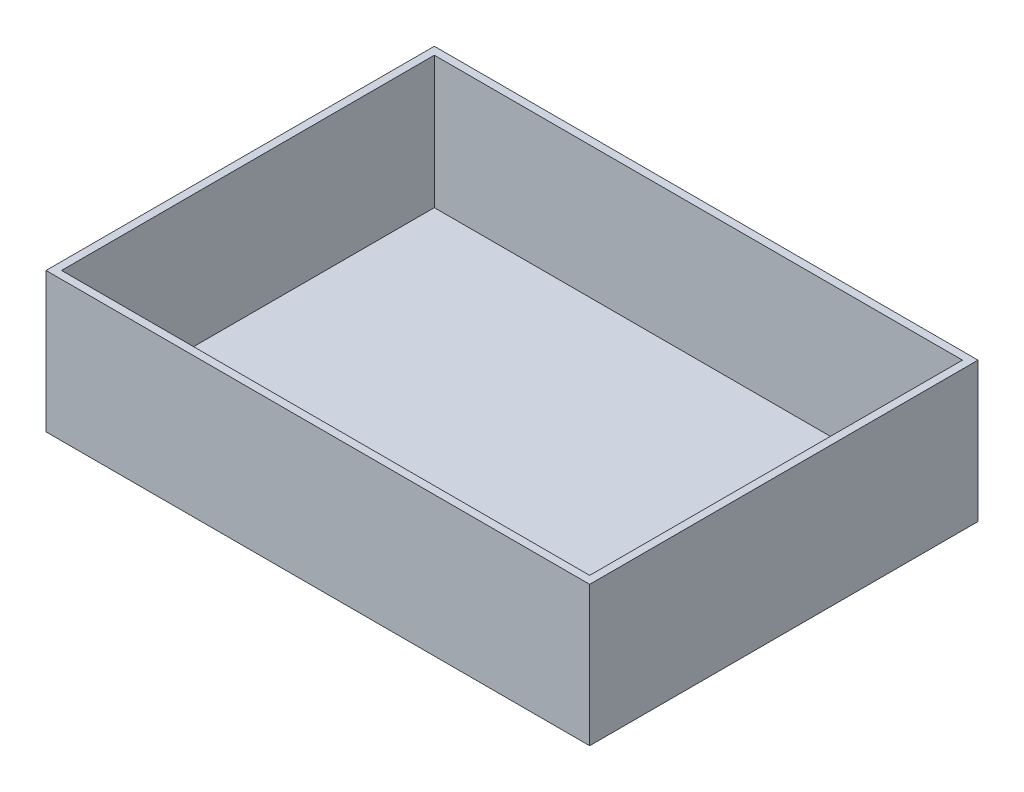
ISO-10303-21;
HEADER;
FILE_DESCRIPTION(('STEP AP214'),'2;1');
FILE_NAME('part.step','',(''),(''),'','','');
FILE_SCHEMA(('AUTOMOTIVE_DESIGN { 1 0 10303 214 1 1 1 1 }'));
ENDSEC;
DATA;
#1=APPLICATION_CONTEXT('core data for automotive mechanical design processes');
#2=APPLICATION_PROTOCOL_DEFINITION('international standard','automotive_design',2000,#1);
#3=PRODUCT_CONTEXT('',#1,'mechanical');
#4=PRODUCT('Part','Part','',(#3));
#5=PRODUCT_RELATED_PRODUCT_CATEGORY('part','',(#4));
#6=PRODUCT_DEFINITION_FORMATION('','',#4);
#7=PRODUCT_DEFINITION_CONTEXT('part definition',#1,'design');
#8=PRODUCT_DEFINITION('design','',#6,#7);
#9=PRODUCT_DEFINITION_SHAPE('','',#8);
#10=(LENGTH_UNIT() NAMED_UNIT(*) SI_UNIT(.MILLI.,.METRE.));
#11=(NAMED_UNIT(*) PLANE_ANGLE_UNIT() SI_UNIT($,.RADIAN.));
#12=(NAMED_UNIT(*) SI_UNIT($,.STERADIAN.) SOLID_ANGLE_UNIT());
#13=UNCERTAINTY_MEASURE_WITH_UNIT(LENGTH_MEASURE(1.E-05),#10,'distance_accuracy_value','');
#14=(GEOMETRIC_REPRESENTATION_CONTEXT(3) GLOBAL_UNCERTAINTY_ASSIGNED_CONTEXT((#13)) GLOBAL_UNIT_ASSIGNED_CONTEXT((#10,
#11,#12)) REPRESENTATION_CONTEXT('',''));
#15=CARTESIAN_POINT('',(0.,0.,0.));
#16=DIRECTION('',(0.,0.,1.));
#17=DIRECTION('',(1.,0.,0.));
#18=AXIS2_PLACEMENT_3D('',#15,#16,#17);
#19=CARTESIAN_POINT('',(-364.202898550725,234.347826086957,500.));
#20=DIRECTION('',(0.,-1.,0.));
#21=DIRECTION('',(0.,0.,-1.));
#22=AXIS2_PLACEMENT_3D('',#19,#20,#21);
#23=PLANE('',#22);
#24=DIRECTION('',(-1.,0.,0.));
#25=VECTOR('',#24,1.);
#26=CARTESIAN_POINT('',(-364.202898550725,234.347826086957,0.));
#27=LINE('',#26,#25);
#28=CARTESIAN_POINT('',(335.797101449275,234.347826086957,0.));
#29=VERTEX_POINT('',#28);
#30=CARTESIAN_POINT('',(-364.202898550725,234.347826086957,0.));
#31=VERTEX_POINT('',#30);
#32=EDGE_CURVE('E77',#29,#31,#27,.T.);
#33=ORIENTED_EDGE('',*,*,#32,.T.);
#34=DIRECTION('',(0.,0.,-1.));
#35=VECTOR('',#34,1.);
#36=CARTESIAN_POINT('',(-364.202898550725,234.347826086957,500.));
#37=LINE('',#36,#35);
#38=CARTESIAN_POINT('',(-364.202898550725,234.347826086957,500.));
#39=VERTEX_POINT('',#38);
#40=EDGE_CURVE('E149',#39,#31,#37,.T.);
#41=ORIENTED_EDGE('',*,*,#40,.F.);
#42=DIRECTION('',(-1.,0.,0.));
#43=VECTOR('',#42,1.);
#44=CARTESIAN_POINT('',(-364.202898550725,234.347826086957,500.));
#45=LINE('',#44,#43);
#46=CARTESIAN_POINT('',(335.797101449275,234.347826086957,500.));
#47=VERTEX_POINT('',#46);
#48=EDGE_CURVE('E56',#47,#39,#45,.T.);
#49=ORIENTED_EDGE('',*,*,#48,.F.);
#50=DIRECTION('',(0.,0.,-1.));
#51=VECTOR('',#50,1.);
#52=CARTESIAN_POINT('',(335.797101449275,234.347826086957,500.));
#53=LINE('',#52,#51);
#54=EDGE_CURVE('E159',#47,#29,#53,.T.);
#55=ORIENTED_EDGE('',*,*,#54,.T.);
#56=EDGE_LOOP('',(#33,#41,#49,#55));
#57=FACE_BOUND('',#56,.T.);
#58=DIRECTION('',(-1.,0.,0.));
#59=VECTOR('',#58,1.);
#60=CARTESIAN_POINT('',(-364.202898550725,234.347826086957,10.));
#61=LINE('',#60,#59);
#62=CARTESIAN_POINT('',(325.797101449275,234.347826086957,10.));
#63=VERTEX_POINT('',#62);
#64=CARTESIAN_POINT('',(-354.202898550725,234.347826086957,10.));
#65=VERTEX_POINT('',#64);
#66=EDGE_CURVE('E130',#63,#65,#61,.T.);
#67=ORIENTED_EDGE('',*,*,#66,.F.);
#68=DIRECTION('',(0.,0.,-1.));
#69=VECTOR('',#68,1.);
#70=CARTESIAN_POINT('',(325.797101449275,234.347826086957,500.));
#71=LINE('',#70,#69);
#72=CARTESIAN_POINT('',(325.797101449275,234.347826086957,490.));
#73=VERTEX_POINT('',#72);
#74=EDGE_CURVE('E125',#73,#63,#71,.T.);
#75=ORIENTED_EDGE('',*,*,#74,.F.);
#76=DIRECTION('',(-1.,0.,0.));
#77=VECTOR('',#76,1.);
#78=CARTESIAN_POINT('',(-364.202898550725,234.347826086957,490.));
#79=LINE('',#78,#77);
#80=CARTESIAN_POINT('',(-354.202898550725,234.347826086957,490.));
#81=VERTEX_POINT('',#80);
#82=EDGE_CURVE('E47',#73,#81,#79,.T.);
#83=ORIENTED_EDGE('',*,*,#82,.T.);
#84=DIRECTION('',(0.,0.,-1.));
#85=VECTOR('',#84,1.);
#86=CARTESIAN_POINT('',(-354.202898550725,234.347826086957,500.));
#87=LINE('',#86,#85);
#88=EDGE_CURVE('E138',#81,#65,#87,.T.);
#89=ORIENTED_EDGE('',*,*,#88,.T.);
#90=EDGE_LOOP('',(#67,#75,#83,#89));
#91=FACE_BOUND('',#90,.T.);
#92=ADVANCED_FACE('F32',(#57,#91),#23,.F.);
#93=CARTESIAN_POINT('',(-364.202898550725,234.347826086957,500.));
#94=DIRECTION('',(1.,0.,0.));
#95=DIRECTION('',(0.,0.,-1.));
#96=AXIS2_PLACEMENT_3D('',#93,#94,#95);
#97=PLANE('',#96);
#98=DIRECTION('',(0.,-1.,0.));
#99=VECTOR('',#98,1.);
#100=CARTESIAN_POINT('',(-364.202898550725,234.347826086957,0.));
#101=LINE('',#100,#99);
#102=CARTESIAN_POINT('',(-364.202898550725,54.3478260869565,0.));
#103=VERTEX_POINT('',#102);
#104=EDGE_CURVE('E150',#31,#103,#101,.T.);
#105=ORIENTED_EDGE('',*,*,#104,.T.);
#106=DIRECTION('',(0.,0.,-1.));
#107=VECTOR('',#106,1.);
#108=CARTESIAN_POINT('',(-364.202898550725,54.3478260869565,500.));
#109=LINE('',#108,#107);
#110=CARTESIAN_POINT('',(-364.202898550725,54.3478260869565,500.));
#111=VERTEX_POINT('',#110);
#112=EDGE_CURVE('E11',#111,#103,#109,.T.);
#113=ORIENTED_EDGE('',*,*,#112,.F.);
#114=DIRECTION('',(0.,-1.,0.));
#115=VECTOR('',#114,1.);
#116=CARTESIAN_POINT('',(-364.202898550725,234.347826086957,500.));
#117=LINE('',#116,#115);
#118=EDGE_CURVE('E143',#39,#111,#117,.T.);
#119=ORIENTED_EDGE('',*,*,#118,.F.);
#120=ORIENTED_EDGE('',*,*,#40,.T.);
#121=EDGE_LOOP('',(#105,#113,#119,#120));
#122=FACE_BOUND('',#121,.T.);
#123=ADVANCED_FACE('F34',(#122),#97,.F.);
#124=CARTESIAN_POINT('',(-364.202898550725,54.3478260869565,500.));
#125=DIRECTION('',(0.,1.,0.));
#126=DIRECTION('',(0.,0.,1.));
#127=AXIS2_PLACEMENT_3D('',#124,#125,#126);
#128=PLANE('',#127);
#129=DIRECTION('',(1.,0.,0.));
#130=VECTOR('',#129,1.);
#131=CARTESIAN_POINT('',(-364.202898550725,54.3478260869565,0.));
#132=LINE('',#131,#130);
#133=CARTESIAN_POINT('',(335.797101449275,54.3478260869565,0.));
#134=VERTEX_POINT('',#133);
#135=EDGE_CURVE('E153',#103,#134,#132,.T.);
#136=ORIENTED_EDGE('',*,*,#135,.T.);
#137=DIRECTION('',(0.,0.,-1.));
#138=VECTOR('',#137,1.);
#139=CARTESIAN_POINT('',(335.797101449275,54.3478260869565,500.));
#140=LINE('',#139,#138);
#141=CARTESIAN_POINT('',(335.797101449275,54.3478260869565,500.));
#142=VERTEX_POINT('',#141);
#143=EDGE_CURVE('E40',#142,#134,#140,.T.);
#144=ORIENTED_EDGE('',*,*,#143,.F.);
#145=DIRECTION('',(1.,0.,0.));
#146=VECTOR('',#145,1.);
#147=CARTESIAN_POINT('',(-364.202898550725,54.3478260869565,500.));
#148=LINE('',#147,#146);
#149=EDGE_CURVE('E84',#111,#142,#148,.T.);
#150=ORIENTED_EDGE('',*,*,#149,.F.);
#151=ORIENTED_EDGE('',*,*,#112,.T.);
#152=EDGE_LOOP('',(#136,#144,#150,#151));
#153=FACE_BOUND('',#152,.T.);
#154=ADVANCED_FACE('F198',(#153),#128,.F.);
#155=CARTESIAN_POINT('',(335.797101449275,234.347826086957,500.));
#156=DIRECTION('',(-1.,0.,0.));
#157=DIRECTION('',(0.,0.,1.));
#158=AXIS2_PLACEMENT_3D('',#155,#156,#157);
#159=PLANE('',#158);
#160=DIRECTION('',(0.,1.,0.));
#161=VECTOR('',#160,1.);
#162=CARTESIAN_POINT('',(335.797101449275,234.347826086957,0.));
#163=LINE('',#162,#161);
#164=EDGE_CURVE('E155',#134,#29,#163,.T.);
#165=ORIENTED_EDGE('',*,*,#164,.T.);
#166=ORIENTED_EDGE('',*,*,#54,.F.);
#167=DIRECTION('',(0.,1.,0.));
#168=VECTOR('',#167,1.);
#169=CARTESIAN_POINT('',(335.797101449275,234.347826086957,500.));
#170=LINE('',#169,#168);
#171=EDGE_CURVE('E146',#142,#47,#170,.T.);
#172=ORIENTED_EDGE('',*,*,#171,.F.);
#173=ORIENTED_EDGE('',*,*,#143,.T.);
#174=EDGE_LOOP('',(#165,#166,#172,#173));
#175=FACE_BOUND('',#174,.T.);
#176=ADVANCED_FACE('F164',(#175),#159,.F.);
#177=CARTESIAN_POINT('',(0.,0.,500.));
#178=DIRECTION('',(0.,0.,1.));
#179=DIRECTION('',(1.,0.,0.));
#180=AXIS2_PLACEMENT_3D('',#177,#178,#179);
#181=PLANE('',#180);
#182=ORIENTED_EDGE('',*,*,#118,.T.);
#183=ORIENTED_EDGE('',*,*,#149,.T.);
#184=ORIENTED_EDGE('',*,*,#171,.T.);
#185=ORIENTED_EDGE('',*,*,#48,.T.);
#186=EDGE_LOOP('',(#182,#183,#184,#185));
#187=FACE_BOUND('',#186,.T.);
#188=ADVANCED_FACE('F192',(#187),#181,.T.);
#189=CARTESIAN_POINT('',(0.,0.,0.));
#190=DIRECTION('',(0.,0.,1.));
#191=DIRECTION('',(1.,0.,0.));
#192=AXIS2_PLACEMENT_3D('',#189,#190,#191);
#193=PLANE('',#192);
#194=ORIENTED_EDGE('',*,*,#104,.F.);
#195=ORIENTED_EDGE('',*,*,#32,.F.);
#196=ORIENTED_EDGE('',*,*,#164,.F.);
#197=ORIENTED_EDGE('',*,*,#135,.F.);
#198=EDGE_LOOP('',(#194,#195,#196,#197));
#199=FACE_BOUND('',#198,.T.);
#200=ADVANCED_FACE('F168',(#199),#193,.F.);
#201=CARTESIAN_POINT('',(-354.202898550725,234.347826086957,500.));
#202=DIRECTION('',(1.,0.,0.));
#203=DIRECTION('',(0.,0.,-1.));
#204=AXIS2_PLACEMENT_3D('',#201,#202,#203);
#205=PLANE('',#204);
#206=DIRECTION('',(0.,-1.,0.));
#207=VECTOR('',#206,1.);
#208=CARTESIAN_POINT('',(-354.202898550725,234.347826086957,10.));
#209=LINE('',#208,#207);
#210=CARTESIAN_POINT('',(-354.202898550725,64.3478260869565,10.));
#211=VERTEX_POINT('',#210);
#212=EDGE_CURVE('E114',#65,#211,#209,.T.);
#213=ORIENTED_EDGE('',*,*,#212,.F.);
#214=ORIENTED_EDGE('',*,*,#88,.F.);
#215=DIRECTION('',(0.,-1.,0.));
#216=VECTOR('',#215,1.);
#217=CARTESIAN_POINT('',(-354.202898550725,234.347826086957,490.));
#218=LINE('',#217,#216);
#219=CARTESIAN_POINT('',(-354.202898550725,64.3478260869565,490.));
#220=VERTEX_POINT('',#219);
#221=EDGE_CURVE('E132',#81,#220,#218,.T.);
#222=ORIENTED_EDGE('',*,*,#221,.T.);
#223=DIRECTION('',(0.,0.,-1.));
#224=VECTOR('',#223,1.);
#225=CARTESIAN_POINT('',(-354.202898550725,64.3478260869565,500.));
#226=LINE('',#225,#224);
#227=EDGE_CURVE('E124',#220,#211,#226,.T.);
#228=ORIENTED_EDGE('',*,*,#227,.T.);
#229=EDGE_LOOP('',(#213,#214,#222,#228));
#230=FACE_BOUND('',#229,.T.);
#231=ADVANCED_FACE('F176',(#230),#205,.T.);
#232=CARTESIAN_POINT('',(-364.202898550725,64.3478260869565,500.));
#233=DIRECTION('',(0.,1.,0.));
#234=DIRECTION('',(0.,0.,1.));
#235=AXIS2_PLACEMENT_3D('',#232,#233,#234);
#236=PLANE('',#235);
#237=DIRECTION('',(1.,0.,0.));
#238=VECTOR('',#237,1.);
#239=CARTESIAN_POINT('',(-364.202898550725,64.3478260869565,10.));
#240=LINE('',#239,#238);
#241=CARTESIAN_POINT('',(325.797101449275,64.3478260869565,10.));
#242=VERTEX_POINT('',#241);
#243=EDGE_CURVE('E107',#211,#242,#240,.T.);
#244=ORIENTED_EDGE('',*,*,#243,.F.);
#245=ORIENTED_EDGE('',*,*,#227,.F.);
#246=DIRECTION('',(1.,0.,0.));
#247=VECTOR('',#246,1.);
#248=CARTESIAN_POINT('',(-364.202898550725,64.3478260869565,490.));
#249=LINE('',#248,#247);
#250=CARTESIAN_POINT('',(325.797101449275,64.3478260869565,490.));
#251=VERTEX_POINT('',#250);
#252=EDGE_CURVE('E122',#220,#251,#249,.T.);
#253=ORIENTED_EDGE('',*,*,#252,.T.);
#254=DIRECTION('',(0.,0.,-1.));
#255=VECTOR('',#254,1.);
#256=CARTESIAN_POINT('',(325.797101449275,64.3478260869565,500.));
#257=LINE('',#256,#255);
#258=EDGE_CURVE('E120',#251,#242,#257,.T.);
#259=ORIENTED_EDGE('',*,*,#258,.T.);
#260=EDGE_LOOP('',(#244,#245,#253,#259));
#261=FACE_BOUND('',#260,.T.);
#262=ADVANCED_FACE('F121',(#261),#236,.T.);
#263=CARTESIAN_POINT('',(325.797101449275,234.347826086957,500.));
#264=DIRECTION('',(-1.,0.,0.));
#265=DIRECTION('',(0.,0.,1.));
#266=AXIS2_PLACEMENT_3D('',#263,#264,#265);
#267=PLANE('',#266);
#268=DIRECTION('',(0.,1.,0.));
#269=VECTOR('',#268,1.);
#270=CARTESIAN_POINT('',(325.797101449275,234.347826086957,10.));
#271=LINE('',#270,#269);
#272=EDGE_CURVE('E111',#242,#63,#271,.T.);
#273=ORIENTED_EDGE('',*,*,#272,.F.);
#274=ORIENTED_EDGE('',*,*,#258,.F.);
#275=DIRECTION('',(0.,1.,0.));
#276=VECTOR('',#275,1.);
#277=CARTESIAN_POINT('',(325.797101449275,234.347826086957,490.));
#278=LINE('',#277,#276);
#279=EDGE_CURVE('E136',#251,#73,#278,.T.);
#280=ORIENTED_EDGE('',*,*,#279,.T.);
#281=ORIENTED_EDGE('',*,*,#74,.T.);
#282=EDGE_LOOP('',(#273,#274,#280,#281));
#283=FACE_BOUND('',#282,.T.);
#284=ADVANCED_FACE('F127',(#283),#267,.T.);
#285=CARTESIAN_POINT('',(0.,0.,490.));
#286=DIRECTION('',(0.,0.,1.));
#287=DIRECTION('',(1.,0.,0.));
#288=AXIS2_PLACEMENT_3D('',#285,#286,#287);
#289=PLANE('',#288);
#290=ORIENTED_EDGE('',*,*,#221,.F.);
#291=ORIENTED_EDGE('',*,*,#82,.F.);
#292=ORIENTED_EDGE('',*,*,#279,.F.);
#293=ORIENTED_EDGE('',*,*,#252,.F.);
#294=EDGE_LOOP('',(#290,#291,#292,#293));
#295=FACE_BOUND('',#294,.T.);
#296=ADVANCED_FACE('F181',(#295),#289,.F.);
#297=CARTESIAN_POINT('',(0.,0.,10.));
#298=DIRECTION('',(0.,0.,1.));
#299=DIRECTION('',(1.,0.,0.));
#300=AXIS2_PLACEMENT_3D('',#297,#298,#299);
#301=PLANE('',#300);
#302=ORIENTED_EDGE('',*,*,#212,.T.);
#303=ORIENTED_EDGE('',*,*,#243,.T.);
#304=ORIENTED_EDGE('',*,*,#272,.T.);
#305=ORIENTED_EDGE('',*,*,#66,.T.);
#306=EDGE_LOOP('',(#302,#303,#304,#305));
#307=FACE_BOUND('',#306,.T.);
#308=ADVANCED_FACE('F109',(#307),#301,.T.);
#309=CLOSED_SHELL('',(#92,#123,#154,#176,#188,#200,#231,#262,#284,#296,#308));
#310=MANIFOLD_SOLID_BREP('B2',#309);
#311=ADVANCED_BREP_SHAPE_REPRESENTATION('',(#18,#310),#14);
#312=SHAPE_DEFINITION_REPRESENTATION(#9,#311);
ENDSEC;
END-ISO-10303-21;
